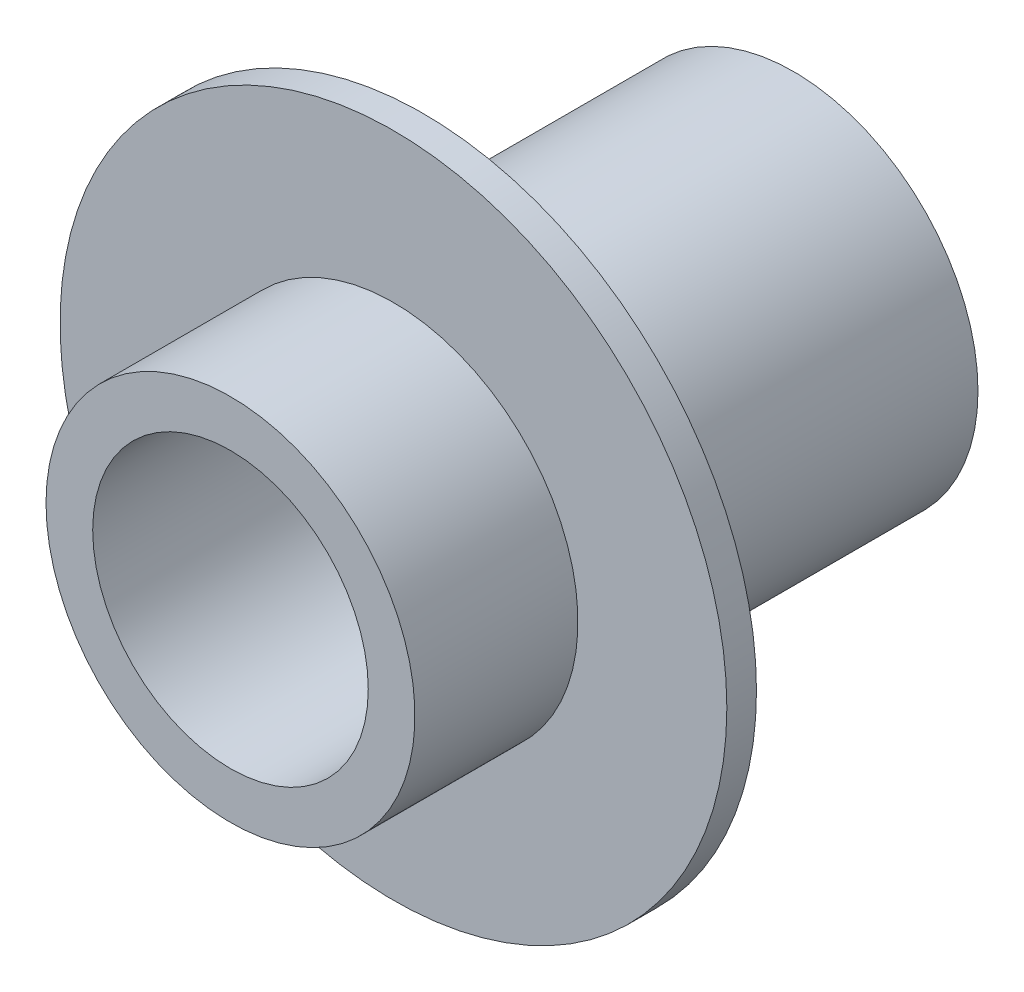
from build123d import *

# Parameters (mm, degrees)
SKETCH1_R           = 3.1623
SKETCH1_R_2         = 2.3622
BASE_EXTRUDE_DEPTH  = 6.35
SKETCH2_R           = 5.715
SKETCH2_R_2         = 2.3622
BOSS_EXTRUDE1_DEPTH = 0.508
SKETCH3_R           = 3.1623
SKETCH3_R_2         = 2.3622
BOSS_EXTRUDE2_DEPTH = 3.302


with BuildPart() as part:
    # Sketch1 → Base-Extrude (new body)
    with BuildSketch(Plane.XY):
        Circle(SKETCH1_R)
        Circle(SKETCH1_R_2, mode=Mode.SUBTRACT)
    extrude(amount=BASE_EXTRUDE_DEPTH)

    # Sketch2 → Boss-Extrude1 (add)
    with BuildSketch(Plane.XY.offset(6.35)):
        Circle(SKETCH2_R)
        Circle(SKETCH2_R_2, mode=Mode.SUBTRACT)
    extrude(amount=BOSS_EXTRUDE1_DEPTH)

    # Sketch3 → Boss-Extrude2 (add)
    with BuildSketch(Plane(origin=(0, 0, 6.35), x_dir=(-1, 0, 0), z_dir=(0, 0, -1))):
        with Locations(Location((0, 0, 0), (0, 0, 180))):
            Circle(SKETCH3_R)
        Circle(SKETCH3_R_2, mode=Mode.SUBTRACT)
    extrude(amount=-BOSS_EXTRUDE2_DEPTH)


solid = part.part
